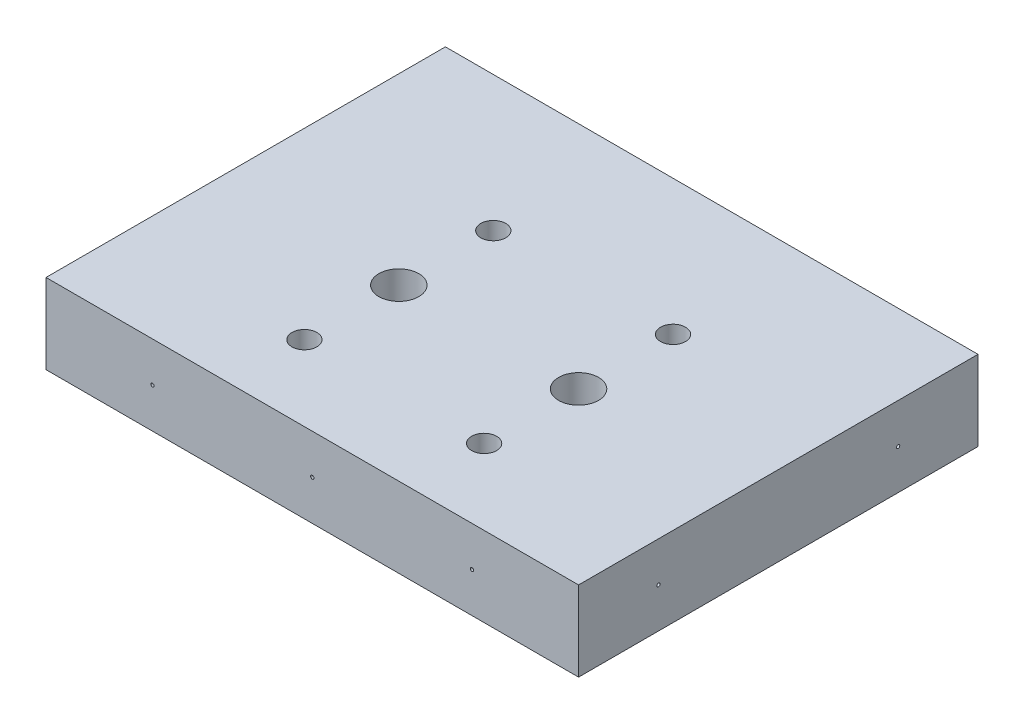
ISO-10303-21;
HEADER;
FILE_DESCRIPTION(('STEP AP214'),'2;1');
FILE_NAME('part.step','',(''),(''),'','','');
FILE_SCHEMA(('AUTOMOTIVE_DESIGN { 1 0 10303 214 1 1 1 1 }'));
ENDSEC;
DATA;
#1=APPLICATION_CONTEXT('core data for automotive mechanical design processes');
#2=APPLICATION_PROTOCOL_DEFINITION('international standard','automotive_design',2000,#1);
#3=PRODUCT_CONTEXT('',#1,'mechanical');
#4=PRODUCT('Part','Part','',(#3));
#5=PRODUCT_RELATED_PRODUCT_CATEGORY('part','',(#4));
#6=PRODUCT_DEFINITION_FORMATION('','',#4);
#7=PRODUCT_DEFINITION_CONTEXT('part definition',#1,'design');
#8=PRODUCT_DEFINITION('design','',#6,#7);
#9=PRODUCT_DEFINITION_SHAPE('','',#8);
#10=(LENGTH_UNIT() NAMED_UNIT(*) SI_UNIT(.MILLI.,.METRE.));
#11=(NAMED_UNIT(*) PLANE_ANGLE_UNIT() SI_UNIT($,.RADIAN.));
#12=(NAMED_UNIT(*) SI_UNIT($,.STERADIAN.) SOLID_ANGLE_UNIT());
#13=UNCERTAINTY_MEASURE_WITH_UNIT(LENGTH_MEASURE(1.E-05),#10,'distance_accuracy_value','');
#14=(GEOMETRIC_REPRESENTATION_CONTEXT(3) GLOBAL_UNCERTAINTY_ASSIGNED_CONTEXT((#13)) GLOBAL_UNIT_ASSIGNED_CONTEXT((#10,
#11,#12)) REPRESENTATION_CONTEXT('',''));
#15=CARTESIAN_POINT('',(0.,0.,0.));
#16=DIRECTION('',(0.,0.,1.));
#17=DIRECTION('',(1.,0.,0.));
#18=AXIS2_PLACEMENT_3D('',#15,#16,#17);
#19=CARTESIAN_POINT('',(0.,38.1,0.));
#20=DIRECTION('',(1.,0.,0.));
#21=DIRECTION('',(0.,0.,-1.));
#22=AXIS2_PLACEMENT_3D('',#19,#20,#21);
#23=PLANE('',#22);
#24=CARTESIAN_POINT('',(0.,19.05,-152.4));
#25=DIRECTION('',(-1.,0.,0.));
#26=DIRECTION('',(0.,0.,1.));
#27=AXIS2_PLACEMENT_3D('',#24,#25,#26);
#28=CIRCLE('',#27,0.793749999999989);
#29=CARTESIAN_POINT('',(0.,19.05,-151.60625));
#30=VERTEX_POINT('',#29);
#31=EDGE_CURVE('E114',#30,#30,#28,.T.);
#32=ORIENTED_EDGE('',*,*,#31,.F.);
#33=EDGE_LOOP('',(#32));
#34=FACE_BOUND('',#33,.T.);
#35=CARTESIAN_POINT('',(0.,19.05,-38.1));
#36=DIRECTION('',(-1.,0.,0.));
#37=DIRECTION('',(0.,0.,1.));
#38=AXIS2_PLACEMENT_3D('',#35,#36,#37);
#39=CIRCLE('',#38,0.793749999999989);
#40=CARTESIAN_POINT('',(0.,19.05,-37.30625));
#41=VERTEX_POINT('',#40);
#42=EDGE_CURVE('E113',#41,#41,#39,.T.);
#43=ORIENTED_EDGE('',*,*,#42,.F.);
#44=EDGE_LOOP('',(#43));
#45=FACE_BOUND('',#44,.T.);
#46=DIRECTION('',(0.,0.,1.));
#47=VECTOR('',#46,1.);
#48=CARTESIAN_POINT('',(0.,0.,0.));
#49=LINE('',#48,#47);
#50=CARTESIAN_POINT('',(0.,0.,-190.5));
#51=VERTEX_POINT('',#50);
#52=CARTESIAN_POINT('',(0.,0.,0.));
#53=VERTEX_POINT('',#52);
#54=EDGE_CURVE('E168',#51,#53,#49,.T.);
#55=ORIENTED_EDGE('',*,*,#54,.T.);
#56=DIRECTION('',(0.,-1.,0.));
#57=VECTOR('',#56,1.);
#58=CARTESIAN_POINT('',(0.,38.1,0.));
#59=LINE('',#58,#57);
#60=CARTESIAN_POINT('',(0.,38.1,0.));
#61=VERTEX_POINT('',#60);
#62=EDGE_CURVE('E11',#61,#53,#59,.T.);
#63=ORIENTED_EDGE('',*,*,#62,.F.);
#64=DIRECTION('',(0.,0.,1.));
#65=VECTOR('',#64,1.);
#66=CARTESIAN_POINT('',(0.,38.1,0.));
#67=LINE('',#66,#65);
#68=CARTESIAN_POINT('',(0.,38.1,-190.5));
#69=VERTEX_POINT('',#68);
#70=EDGE_CURVE('E169',#69,#61,#67,.T.);
#71=ORIENTED_EDGE('',*,*,#70,.F.);
#72=DIRECTION('',(0.,-1.,0.));
#73=VECTOR('',#72,1.);
#74=CARTESIAN_POINT('',(0.,38.1,-190.5));
#75=LINE('',#74,#73);
#76=EDGE_CURVE('E175',#69,#51,#75,.T.);
#77=ORIENTED_EDGE('',*,*,#76,.T.);
#78=EDGE_LOOP('',(#55,#63,#71,#77));
#79=FACE_BOUND('',#78,.T.);
#80=ADVANCED_FACE('F34',(#34,#45,#79),#23,.F.);
#81=CARTESIAN_POINT('',(0.,38.1,0.));
#82=DIRECTION('',(0.,0.,-1.));
#83=DIRECTION('',(-1.,0.,0.));
#84=AXIS2_PLACEMENT_3D('',#81,#82,#83);
#85=PLANE('',#84);
#86=CARTESIAN_POINT('',(50.8,19.05,0.));
#87=DIRECTION('',(0.,0.,1.));
#88=DIRECTION('',(1.,0.,0.));
#89=AXIS2_PLACEMENT_3D('',#86,#87,#88);
#90=CIRCLE('',#89,0.793749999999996);
#91=CARTESIAN_POINT('',(51.59375,19.05,0.));
#92=VERTEX_POINT('',#91);
#93=EDGE_CURVE('E150',#92,#92,#90,.T.);
#94=ORIENTED_EDGE('',*,*,#93,.F.);
#95=EDGE_LOOP('',(#94));
#96=FACE_BOUND('',#95,.T.);
#97=CARTESIAN_POINT('',(203.2,19.05,0.));
#98=DIRECTION('',(0.,0.,1.));
#99=DIRECTION('',(1.,0.,0.));
#100=AXIS2_PLACEMENT_3D('',#97,#98,#99);
#101=CIRCLE('',#100,0.793749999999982);
#102=CARTESIAN_POINT('',(203.99375,19.05,0.));
#103=VERTEX_POINT('',#102);
#104=EDGE_CURVE('E156',#103,#103,#101,.T.);
#105=ORIENTED_EDGE('',*,*,#104,.F.);
#106=EDGE_LOOP('',(#105));
#107=FACE_BOUND('',#106,.T.);
#108=CARTESIAN_POINT('',(127.,19.05,0.));
#109=DIRECTION('',(0.,0.,1.));
#110=DIRECTION('',(1.,0.,0.));
#111=AXIS2_PLACEMENT_3D('',#108,#109,#110);
#112=CIRCLE('',#111,0.793749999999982);
#113=CARTESIAN_POINT('',(127.79375,19.05,0.));
#114=VERTEX_POINT('',#113);
#115=EDGE_CURVE('E162',#114,#114,#112,.T.);
#116=ORIENTED_EDGE('',*,*,#115,.F.);
#117=EDGE_LOOP('',(#116));
#118=FACE_BOUND('',#117,.T.);
#119=DIRECTION('',(1.,0.,0.));
#120=VECTOR('',#119,1.);
#121=CARTESIAN_POINT('',(0.,0.,0.));
#122=LINE('',#121,#120);
#123=CARTESIAN_POINT('',(254.,0.,0.));
#124=VERTEX_POINT('',#123);
#125=EDGE_CURVE('E178',#53,#124,#122,.T.);
#126=ORIENTED_EDGE('',*,*,#125,.T.);
#127=DIRECTION('',(0.,-1.,0.));
#128=VECTOR('',#127,1.);
#129=CARTESIAN_POINT('',(254.,38.1,0.));
#130=LINE('',#129,#128);
#131=CARTESIAN_POINT('',(254.,38.1,0.));
#132=VERTEX_POINT('',#131);
#133=EDGE_CURVE('E42',#132,#124,#130,.T.);
#134=ORIENTED_EDGE('',*,*,#133,.F.);
#135=DIRECTION('',(1.,0.,0.));
#136=VECTOR('',#135,1.);
#137=CARTESIAN_POINT('',(0.,38.1,0.));
#138=LINE('',#137,#136);
#139=EDGE_CURVE('E81',#61,#132,#138,.T.);
#140=ORIENTED_EDGE('',*,*,#139,.F.);
#141=ORIENTED_EDGE('',*,*,#62,.T.);
#142=EDGE_LOOP('',(#126,#134,#140,#141));
#143=FACE_BOUND('',#142,.T.);
#144=ADVANCED_FACE('F202',(#96,#107,#118,#143),#85,.F.);
#145=CARTESIAN_POINT('',(254.,38.1,0.));
#146=DIRECTION('',(-1.,0.,0.));
#147=DIRECTION('',(0.,0.,1.));
#148=AXIS2_PLACEMENT_3D('',#145,#146,#147);
#149=PLANE('',#148);
#150=CARTESIAN_POINT('',(254.,19.05,-152.4));
#151=DIRECTION('',(1.,0.,0.));
#152=DIRECTION('',(0.,0.,-1.));
#153=AXIS2_PLACEMENT_3D('',#150,#151,#152);
#154=CIRCLE('',#153,0.793749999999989);
#155=CARTESIAN_POINT('',(254.,19.05,-153.19375));
#156=VERTEX_POINT('',#155);
#157=EDGE_CURVE('E126',#156,#156,#154,.T.);
#158=ORIENTED_EDGE('',*,*,#157,.F.);
#159=EDGE_LOOP('',(#158));
#160=FACE_BOUND('',#159,.T.);
#161=CARTESIAN_POINT('',(254.,19.05,-38.1000000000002));
#162=DIRECTION('',(1.,0.,0.));
#163=DIRECTION('',(0.,0.,-1.));
#164=AXIS2_PLACEMENT_3D('',#161,#162,#163);
#165=CIRCLE('',#164,0.793749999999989);
#166=CARTESIAN_POINT('',(254.,19.05,-38.8937500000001));
#167=VERTEX_POINT('',#166);
#168=EDGE_CURVE('E132',#167,#167,#165,.T.);
#169=ORIENTED_EDGE('',*,*,#168,.F.);
#170=EDGE_LOOP('',(#169));
#171=FACE_BOUND('',#170,.T.);
#172=DIRECTION('',(0.,0.,-1.));
#173=VECTOR('',#172,1.);
#174=CARTESIAN_POINT('',(254.,0.,0.));
#175=LINE('',#174,#173);
#176=CARTESIAN_POINT('',(254.,0.,-190.5));
#177=VERTEX_POINT('',#176);
#178=EDGE_CURVE('E68',#124,#177,#175,.T.);
#179=ORIENTED_EDGE('',*,*,#178,.T.);
#180=DIRECTION('',(0.,-1.,0.));
#181=VECTOR('',#180,1.);
#182=CARTESIAN_POINT('',(254.,38.1,-190.5));
#183=LINE('',#182,#181);
#184=CARTESIAN_POINT('',(254.,38.1,-190.5));
#185=VERTEX_POINT('',#184);
#186=EDGE_CURVE('E183',#185,#177,#183,.T.);
#187=ORIENTED_EDGE('',*,*,#186,.F.);
#188=DIRECTION('',(0.,0.,-1.));
#189=VECTOR('',#188,1.);
#190=CARTESIAN_POINT('',(254.,38.1,0.));
#191=LINE('',#190,#189);
#192=EDGE_CURVE('E172',#132,#185,#191,.T.);
#193=ORIENTED_EDGE('',*,*,#192,.F.);
#194=ORIENTED_EDGE('',*,*,#133,.T.);
#195=EDGE_LOOP('',(#179,#187,#193,#194));
#196=FACE_BOUND('',#195,.T.);
#197=ADVANCED_FACE('F185',(#160,#171,#196),#149,.F.);
#198=CARTESIAN_POINT('',(0.,38.1,-190.5));
#199=DIRECTION('',(0.,0.,1.));
#200=DIRECTION('',(1.,0.,0.));
#201=AXIS2_PLACEMENT_3D('',#198,#199,#200);
#202=PLANE('',#201);
#203=DIRECTION('',(-1.,0.,0.));
#204=VECTOR('',#203,1.);
#205=CARTESIAN_POINT('',(0.,0.,-190.5));
#206=LINE('',#205,#204);
#207=EDGE_CURVE('E74',#177,#51,#206,.T.);
#208=ORIENTED_EDGE('',*,*,#207,.T.);
#209=ORIENTED_EDGE('',*,*,#76,.F.);
#210=DIRECTION('',(-1.,0.,0.));
#211=VECTOR('',#210,1.);
#212=CARTESIAN_POINT('',(0.,38.1,-190.5));
#213=LINE('',#212,#211);
#214=EDGE_CURVE('E50',#185,#69,#213,.T.);
#215=ORIENTED_EDGE('',*,*,#214,.F.);
#216=ORIENTED_EDGE('',*,*,#186,.T.);
#217=EDGE_LOOP('',(#208,#209,#215,#216));
#218=FACE_BOUND('',#217,.T.);
#219=ADVANCED_FACE('F192',(#218),#202,.F.);
#220=CARTESIAN_POINT('',(0.,38.1,0.));
#221=DIRECTION('',(0.,-1.,0.));
#222=DIRECTION('',(0.,0.,-1.));
#223=AXIS2_PLACEMENT_3D('',#220,#221,#222);
#224=PLANE('',#223);
#225=CARTESIAN_POINT('',(87.3125000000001,38.1,-35.9171875));
#226=DIRECTION('',(0.,1.,0.));
#227=DIRECTION('',(0.,0.,1.));
#228=AXIS2_PLACEMENT_3D('',#225,#226,#227);
#229=CIRCLE('',#228,5.95312499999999);
#230=CARTESIAN_POINT('',(87.3125000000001,38.1,-29.9640625));
#231=VERTEX_POINT('',#230);
#232=EDGE_CURVE('E313',#231,#231,#229,.T.);
#233=ORIENTED_EDGE('',*,*,#232,.F.);
#234=EDGE_LOOP('',(#233));
#235=FACE_BOUND('',#234,.T.);
#236=CARTESIAN_POINT('',(87.3125000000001,38.1,-126.0078125));
#237=DIRECTION('',(0.,1.,0.));
#238=DIRECTION('',(0.,0.,1.));
#239=AXIS2_PLACEMENT_3D('',#236,#237,#238);
#240=CIRCLE('',#239,5.95312499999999);
#241=CARTESIAN_POINT('',(87.3125000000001,38.1,-120.0546875));
#242=VERTEX_POINT('',#241);
#243=EDGE_CURVE('E309',#242,#242,#240,.T.);
#244=ORIENTED_EDGE('',*,*,#243,.F.);
#245=EDGE_LOOP('',(#244));
#246=FACE_BOUND('',#245,.T.);
#247=CARTESIAN_POINT('',(173.0375,38.1,-126.0078125));
#248=DIRECTION('',(0.,1.,0.));
#249=DIRECTION('',(0.,0.,1.));
#250=AXIS2_PLACEMENT_3D('',#247,#248,#249);
#251=CIRCLE('',#250,5.95312499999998);
#252=CARTESIAN_POINT('',(173.0375,38.1,-120.0546875));
#253=VERTEX_POINT('',#252);
#254=EDGE_CURVE('E305',#253,#253,#251,.T.);
#255=ORIENTED_EDGE('',*,*,#254,.F.);
#256=EDGE_LOOP('',(#255));
#257=FACE_BOUND('',#256,.T.);
#258=CARTESIAN_POINT('',(173.0375,38.1,-35.9171875));
#259=DIRECTION('',(0.,1.,0.));
#260=DIRECTION('',(0.,0.,1.));
#261=AXIS2_PLACEMENT_3D('',#258,#259,#260);
#262=CIRCLE('',#261,5.95312499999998);
#263=CARTESIAN_POINT('',(173.0375,38.1,-29.9640625));
#264=VERTEX_POINT('',#263);
#265=EDGE_CURVE('E300',#264,#264,#262,.T.);
#266=ORIENTED_EDGE('',*,*,#265,.F.);
#267=EDGE_LOOP('',(#266));
#268=FACE_BOUND('',#267,.T.);
#269=CARTESIAN_POINT('',(173.0375,38.1,-80.9625));
#270=DIRECTION('',(0.,-1.,0.));
#271=DIRECTION('',(0.,0.,-1.));
#272=AXIS2_PLACEMENT_3D('',#269,#270,#271);
#273=CIRCLE('',#272,9.52499999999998);
#274=CARTESIAN_POINT('',(173.0375,38.1,-90.4875));
#275=VERTEX_POINT('',#274);
#276=EDGE_CURVE('E141',#275,#275,#273,.T.);
#277=ORIENTED_EDGE('',*,*,#276,.T.);
#278=EDGE_LOOP('',(#277));
#279=FACE_BOUND('',#278,.T.);
#280=CARTESIAN_POINT('',(87.3125000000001,38.1,-80.9625));
#281=DIRECTION('',(0.,-1.,0.));
#282=DIRECTION('',(0.,0.,-1.));
#283=AXIS2_PLACEMENT_3D('',#280,#281,#282);
#284=CIRCLE('',#283,9.52499999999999);
#285=CARTESIAN_POINT('',(87.3125000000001,38.1,-90.4875));
#286=VERTEX_POINT('',#285);
#287=EDGE_CURVE('E147',#286,#286,#284,.T.);
#288=ORIENTED_EDGE('',*,*,#287,.T.);
#289=EDGE_LOOP('',(#288));
#290=FACE_BOUND('',#289,.T.);
#291=ORIENTED_EDGE('',*,*,#70,.T.);
#292=ORIENTED_EDGE('',*,*,#139,.T.);
#293=ORIENTED_EDGE('',*,*,#192,.T.);
#294=ORIENTED_EDGE('',*,*,#214,.T.);
#295=EDGE_LOOP('',(#291,#292,#293,#294));
#296=FACE_BOUND('',#295,.T.);
#297=ADVANCED_FACE('F194',(#235,#246,#257,#268,#279,#290,#296),#224,.F.);
#298=CARTESIAN_POINT('',(0.,0.,0.));
#299=DIRECTION('',(0.,-1.,0.));
#300=DIRECTION('',(0.,0.,-1.));
#301=AXIS2_PLACEMENT_3D('',#298,#299,#300);
#302=PLANE('',#301);
#303=CARTESIAN_POINT('',(87.3125000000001,0.,-35.9171875));
#304=DIRECTION('',(0.,1.,0.));
#305=DIRECTION('',(0.,0.,1.));
#306=AXIS2_PLACEMENT_3D('',#303,#304,#305);
#307=CIRCLE('',#306,5.95312499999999);
#308=CARTESIAN_POINT('',(87.3125000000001,0.,-29.9640625));
#309=VERTEX_POINT('',#308);
#310=EDGE_CURVE('E282',#309,#309,#307,.T.);
#311=ORIENTED_EDGE('',*,*,#310,.T.);
#312=EDGE_LOOP('',(#311));
#313=FACE_BOUND('',#312,.T.);
#314=CARTESIAN_POINT('',(87.3125000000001,0.,-126.0078125));
#315=DIRECTION('',(0.,1.,0.));
#316=DIRECTION('',(0.,0.,1.));
#317=AXIS2_PLACEMENT_3D('',#314,#315,#316);
#318=CIRCLE('',#317,5.95312499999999);
#319=CARTESIAN_POINT('',(87.3125000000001,0.,-120.0546875));
#320=VERTEX_POINT('',#319);
#321=EDGE_CURVE('E286',#320,#320,#318,.T.);
#322=ORIENTED_EDGE('',*,*,#321,.T.);
#323=EDGE_LOOP('',(#322));
#324=FACE_BOUND('',#323,.T.);
#325=CARTESIAN_POINT('',(173.0375,0.,-126.0078125));
#326=DIRECTION('',(0.,1.,0.));
#327=DIRECTION('',(0.,0.,1.));
#328=AXIS2_PLACEMENT_3D('',#325,#326,#327);
#329=CIRCLE('',#328,5.95312499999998);
#330=CARTESIAN_POINT('',(173.0375,0.,-120.0546875));
#331=VERTEX_POINT('',#330);
#332=EDGE_CURVE('E290',#331,#331,#329,.T.);
#333=ORIENTED_EDGE('',*,*,#332,.T.);
#334=EDGE_LOOP('',(#333));
#335=FACE_BOUND('',#334,.T.);
#336=CARTESIAN_POINT('',(173.0375,0.,-35.9171875));
#337=DIRECTION('',(0.,1.,0.));
#338=DIRECTION('',(0.,0.,1.));
#339=AXIS2_PLACEMENT_3D('',#336,#337,#338);
#340=CIRCLE('',#339,5.95312499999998);
#341=CARTESIAN_POINT('',(173.0375,0.,-29.9640625));
#342=VERTEX_POINT('',#341);
#343=EDGE_CURVE('E120',#342,#342,#340,.T.);
#344=ORIENTED_EDGE('',*,*,#343,.T.);
#345=EDGE_LOOP('',(#344));
#346=FACE_BOUND('',#345,.T.);
#347=CARTESIAN_POINT('',(173.0375,0.,-80.9625));
#348=DIRECTION('',(0.,-1.,0.));
#349=DIRECTION('',(0.,0.,-1.));
#350=AXIS2_PLACEMENT_3D('',#347,#348,#349);
#351=CIRCLE('',#350,9.52500000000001);
#352=CARTESIAN_POINT('',(173.0375,0.,-90.4875));
#353=VERTEX_POINT('',#352);
#354=EDGE_CURVE('E138',#353,#353,#351,.T.);
#355=ORIENTED_EDGE('',*,*,#354,.F.);
#356=EDGE_LOOP('',(#355));
#357=FACE_BOUND('',#356,.T.);
#358=CARTESIAN_POINT('',(87.3125000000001,0.,-80.9625));
#359=DIRECTION('',(0.,-1.,0.));
#360=DIRECTION('',(0.,0.,-1.));
#361=AXIS2_PLACEMENT_3D('',#358,#359,#360);
#362=CIRCLE('',#361,9.52499999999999);
#363=CARTESIAN_POINT('',(87.3125000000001,0.,-90.4875));
#364=VERTEX_POINT('',#363);
#365=EDGE_CURVE('E144',#364,#364,#362,.T.);
#366=ORIENTED_EDGE('',*,*,#365,.F.);
#367=EDGE_LOOP('',(#366));
#368=FACE_BOUND('',#367,.T.);
#369=ORIENTED_EDGE('',*,*,#54,.F.);
#370=ORIENTED_EDGE('',*,*,#207,.F.);
#371=ORIENTED_EDGE('',*,*,#178,.F.);
#372=ORIENTED_EDGE('',*,*,#125,.F.);
#373=EDGE_LOOP('',(#369,#370,#371,#372));
#374=FACE_BOUND('',#373,.T.);
#375=ADVANCED_FACE('F188',(#313,#324,#335,#346,#357,#368,#374),#302,.T.);
#376=CARTESIAN_POINT('',(127.,19.05,-50.8));
#377=DIRECTION('',(0.,0.,1.));
#378=DIRECTION('',(1.,0.,0.));
#379=AXIS2_PLACEMENT_3D('',#376,#377,#378);
#380=CONICAL_SURFACE('',#379,0.793749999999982,1.02974425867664);
#381=CARTESIAN_POINT('',(127.,19.05,-51.2769331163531));
#382=VERTEX_POINT('',#381);
#383=VERTEX_LOOP('',#382);
#384=FACE_BOUND('',#383,.T.);
#385=CARTESIAN_POINT('',(127.,19.05,-50.8));
#386=DIRECTION('',(0.,0.,1.));
#387=DIRECTION('',(1.,0.,0.));
#388=AXIS2_PLACEMENT_3D('',#385,#386,#387);
#389=CIRCLE('',#388,0.793749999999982);
#390=CARTESIAN_POINT('',(127.79375,19.05,-50.8));
#391=VERTEX_POINT('',#390);
#392=EDGE_CURVE('E165',#391,#391,#389,.T.);
#393=ORIENTED_EDGE('',*,*,#392,.T.);
#394=EDGE_LOOP('',(#393));
#395=FACE_BOUND('',#394,.T.);
#396=ADVANCED_FACE('F271',(#384,#395),#380,.F.);
#397=CARTESIAN_POINT('',(127.,19.05,0.));
#398=DIRECTION('',(0.,0.,1.));
#399=DIRECTION('',(1.,0.,0.));
#400=AXIS2_PLACEMENT_3D('',#397,#398,#399);
#401=CYLINDRICAL_SURFACE('',#400,0.793749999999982);
#402=ORIENTED_EDGE('',*,*,#392,.F.);
#403=EDGE_LOOP('',(#402));
#404=FACE_BOUND('',#403,.T.);
#405=ORIENTED_EDGE('',*,*,#115,.T.);
#406=EDGE_LOOP('',(#405));
#407=FACE_BOUND('',#406,.T.);
#408=ADVANCED_FACE('F267',(#404,#407),#401,.F.);
#409=CARTESIAN_POINT('',(203.2,19.05,-50.8));
#410=DIRECTION('',(0.,0.,1.));
#411=DIRECTION('',(1.,0.,0.));
#412=AXIS2_PLACEMENT_3D('',#409,#410,#411);
#413=CONICAL_SURFACE('',#412,0.793749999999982,1.02974425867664);
#414=CARTESIAN_POINT('',(203.2,19.05,-51.2769331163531));
#415=VERTEX_POINT('',#414);
#416=VERTEX_LOOP('',#415);
#417=FACE_BOUND('',#416,.T.);
#418=CARTESIAN_POINT('',(203.2,19.05,-50.8));
#419=DIRECTION('',(0.,0.,1.));
#420=DIRECTION('',(1.,0.,0.));
#421=AXIS2_PLACEMENT_3D('',#418,#419,#420);
#422=CIRCLE('',#421,0.793749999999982);
#423=CARTESIAN_POINT('',(203.99375,19.05,-50.8));
#424=VERTEX_POINT('',#423);
#425=EDGE_CURVE('E159',#424,#424,#422,.T.);
#426=ORIENTED_EDGE('',*,*,#425,.T.);
#427=EDGE_LOOP('',(#426));
#428=FACE_BOUND('',#427,.T.);
#429=ADVANCED_FACE('F263',(#417,#428),#413,.F.);
#430=CARTESIAN_POINT('',(203.2,19.05,0.));
#431=DIRECTION('',(0.,0.,1.));
#432=DIRECTION('',(1.,0.,0.));
#433=AXIS2_PLACEMENT_3D('',#430,#431,#432);
#434=CYLINDRICAL_SURFACE('',#433,0.793749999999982);
#435=ORIENTED_EDGE('',*,*,#425,.F.);
#436=EDGE_LOOP('',(#435));
#437=FACE_BOUND('',#436,.T.);
#438=ORIENTED_EDGE('',*,*,#104,.T.);
#439=EDGE_LOOP('',(#438));
#440=FACE_BOUND('',#439,.T.);
#441=ADVANCED_FACE('F259',(#437,#440),#434,.F.);
#442=CARTESIAN_POINT('',(50.8,19.05,-50.8));
#443=DIRECTION('',(0.,0.,1.));
#444=DIRECTION('',(1.,0.,0.));
#445=AXIS2_PLACEMENT_3D('',#442,#443,#444);
#446=CONICAL_SURFACE('',#445,0.793749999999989,1.02974425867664);
#447=CARTESIAN_POINT('',(50.8,19.05,-51.2769331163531));
#448=VERTEX_POINT('',#447);
#449=VERTEX_LOOP('',#448);
#450=FACE_BOUND('',#449,.T.);
#451=CARTESIAN_POINT('',(50.8,19.05,-50.8));
#452=DIRECTION('',(0.,0.,1.));
#453=DIRECTION('',(1.,0.,0.));
#454=AXIS2_PLACEMENT_3D('',#451,#452,#453);
#455=CIRCLE('',#454,0.793749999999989);
#456=CARTESIAN_POINT('',(51.59375,19.05,-50.8));
#457=VERTEX_POINT('',#456);
#458=EDGE_CURVE('E153',#457,#457,#455,.T.);
#459=ORIENTED_EDGE('',*,*,#458,.T.);
#460=EDGE_LOOP('',(#459));
#461=FACE_BOUND('',#460,.T.);
#462=ADVANCED_FACE('F255',(#450,#461),#446,.F.);
#463=CARTESIAN_POINT('',(50.8,19.05,0.));
#464=DIRECTION('',(0.,0.,1.));
#465=DIRECTION('',(1.,0.,0.));
#466=AXIS2_PLACEMENT_3D('',#463,#464,#465);
#467=CYLINDRICAL_SURFACE('',#466,0.793749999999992);
#468=ORIENTED_EDGE('',*,*,#458,.F.);
#469=EDGE_LOOP('',(#468));
#470=FACE_BOUND('',#469,.T.);
#471=ORIENTED_EDGE('',*,*,#93,.T.);
#472=EDGE_LOOP('',(#471));
#473=FACE_BOUND('',#472,.T.);
#474=ADVANCED_FACE('F251',(#470,#473),#467,.F.);
#475=CARTESIAN_POINT('',(87.3125000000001,0.,-80.9625));
#476=DIRECTION('',(0.,-1.,0.));
#477=DIRECTION('',(0.,0.,-1.));
#478=AXIS2_PLACEMENT_3D('',#475,#476,#477);
#479=CYLINDRICAL_SURFACE('',#478,9.52499999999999);
#480=ORIENTED_EDGE('',*,*,#287,.F.);
#481=EDGE_LOOP('',(#480));
#482=FACE_BOUND('',#481,.T.);
#483=ORIENTED_EDGE('',*,*,#365,.T.);
#484=EDGE_LOOP('',(#483));
#485=FACE_BOUND('',#484,.T.);
#486=ADVANCED_FACE('F247',(#482,#485),#479,.F.);
#487=CARTESIAN_POINT('',(173.0375,0.,-80.9625));
#488=DIRECTION('',(0.,-1.,0.));
#489=DIRECTION('',(0.,0.,-1.));
#490=AXIS2_PLACEMENT_3D('',#487,#488,#489);
#491=CYLINDRICAL_SURFACE('',#490,9.52499999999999);
#492=ORIENTED_EDGE('',*,*,#276,.F.);
#493=EDGE_LOOP('',(#492));
#494=FACE_BOUND('',#493,.T.);
#495=ORIENTED_EDGE('',*,*,#354,.T.);
#496=EDGE_LOOP('',(#495));
#497=FACE_BOUND('',#496,.T.);
#498=ADVANCED_FACE('F243',(#494,#497),#491,.F.);
#499=CARTESIAN_POINT('',(215.9,19.05,-38.1000000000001));
#500=DIRECTION('',(1.,0.,0.));
#501=DIRECTION('',(0.,0.,-1.));
#502=AXIS2_PLACEMENT_3D('',#499,#500,#501);
#503=CONICAL_SURFACE('',#502,0.793749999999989,1.02974425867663);
#504=CARTESIAN_POINT('',(215.423066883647,19.05,-38.1000000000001));
#505=VERTEX_POINT('',#504);
#506=VERTEX_LOOP('',#505);
#507=FACE_BOUND('',#506,.T.);
#508=CARTESIAN_POINT('',(215.9,19.05,-38.1000000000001));
#509=DIRECTION('',(1.,0.,0.));
#510=DIRECTION('',(0.,0.,-1.));
#511=AXIS2_PLACEMENT_3D('',#508,#509,#510);
#512=CIRCLE('',#511,0.793749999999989);
#513=CARTESIAN_POINT('',(215.9,19.05,-38.8937500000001));
#514=VERTEX_POINT('',#513);
#515=EDGE_CURVE('E135',#514,#514,#512,.T.);
#516=ORIENTED_EDGE('',*,*,#515,.T.);
#517=EDGE_LOOP('',(#516));
#518=FACE_BOUND('',#517,.T.);
#519=ADVANCED_FACE('F239',(#507,#518),#503,.F.);
#520=CARTESIAN_POINT('',(254.,19.05,-38.1000000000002));
#521=DIRECTION('',(1.,0.,0.));
#522=DIRECTION('',(0.,0.,-1.));
#523=AXIS2_PLACEMENT_3D('',#520,#521,#522);
#524=CYLINDRICAL_SURFACE('',#523,0.793749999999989);
#525=ORIENTED_EDGE('',*,*,#515,.F.);
#526=EDGE_LOOP('',(#525));
#527=FACE_BOUND('',#526,.T.);
#528=ORIENTED_EDGE('',*,*,#168,.T.);
#529=EDGE_LOOP('',(#528));
#530=FACE_BOUND('',#529,.T.);
#531=ADVANCED_FACE('F235',(#527,#530),#524,.F.);
#532=CARTESIAN_POINT('',(215.9,19.05,-152.4));
#533=DIRECTION('',(1.,0.,0.));
#534=DIRECTION('',(0.,0.,-1.));
#535=AXIS2_PLACEMENT_3D('',#532,#533,#534);
#536=CONICAL_SURFACE('',#535,0.793749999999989,1.02974425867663);
#537=CARTESIAN_POINT('',(215.423066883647,19.05,-152.4));
#538=VERTEX_POINT('',#537);
#539=VERTEX_LOOP('',#538);
#540=FACE_BOUND('',#539,.T.);
#541=CARTESIAN_POINT('',(215.9,19.05,-152.4));
#542=DIRECTION('',(1.,0.,0.));
#543=DIRECTION('',(0.,0.,-1.));
#544=AXIS2_PLACEMENT_3D('',#541,#542,#543);
#545=CIRCLE('',#544,0.793749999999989);
#546=CARTESIAN_POINT('',(215.9,19.05,-153.19375));
#547=VERTEX_POINT('',#546);
#548=EDGE_CURVE('E129',#547,#547,#545,.T.);
#549=ORIENTED_EDGE('',*,*,#548,.T.);
#550=EDGE_LOOP('',(#549));
#551=FACE_BOUND('',#550,.T.);
#552=ADVANCED_FACE('F231',(#540,#551),#536,.F.);
#553=CARTESIAN_POINT('',(254.,19.05,-152.4));
#554=DIRECTION('',(1.,0.,0.));
#555=DIRECTION('',(0.,0.,-1.));
#556=AXIS2_PLACEMENT_3D('',#553,#554,#555);
#557=CYLINDRICAL_SURFACE('',#556,0.793749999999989);
#558=ORIENTED_EDGE('',*,*,#548,.F.);
#559=EDGE_LOOP('',(#558));
#560=FACE_BOUND('',#559,.T.);
#561=ORIENTED_EDGE('',*,*,#157,.T.);
#562=EDGE_LOOP('',(#561));
#563=FACE_BOUND('',#562,.T.);
#564=ADVANCED_FACE('F223',(#560,#563),#557,.F.);
#565=CARTESIAN_POINT('',(38.1,19.05,-38.1));
#566=DIRECTION('',(-1.,0.,0.));
#567=DIRECTION('',(0.,0.,1.));
#568=AXIS2_PLACEMENT_3D('',#565,#566,#567);
#569=CONICAL_SURFACE('',#568,0.793749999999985,1.02974425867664);
#570=CARTESIAN_POINT('',(38.5769331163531,19.05,-38.1));
#571=VERTEX_POINT('',#570);
#572=VERTEX_LOOP('',#571);
#573=FACE_BOUND('',#572,.T.);
#574=CARTESIAN_POINT('',(38.1,19.05,-38.1));
#575=DIRECTION('',(-1.,0.,0.));
#576=DIRECTION('',(0.,0.,1.));
#577=AXIS2_PLACEMENT_3D('',#574,#575,#576);
#578=CIRCLE('',#577,0.793749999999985);
#579=CARTESIAN_POINT('',(38.1,19.05,-37.30625));
#580=VERTEX_POINT('',#579);
#581=EDGE_CURVE('E117',#580,#580,#578,.T.);
#582=ORIENTED_EDGE('',*,*,#581,.T.);
#583=EDGE_LOOP('',(#582));
#584=FACE_BOUND('',#583,.T.);
#585=ADVANCED_FACE('F217',(#573,#584),#569,.F.);
#586=CARTESIAN_POINT('',(0.,19.05,-38.1));
#587=DIRECTION('',(-1.,0.,0.));
#588=DIRECTION('',(0.,0.,1.));
#589=AXIS2_PLACEMENT_3D('',#586,#587,#588);
#590=CYLINDRICAL_SURFACE('',#589,0.793749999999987);
#591=ORIENTED_EDGE('',*,*,#581,.F.);
#592=EDGE_LOOP('',(#591));
#593=FACE_BOUND('',#592,.T.);
#594=ORIENTED_EDGE('',*,*,#42,.T.);
#595=EDGE_LOOP('',(#594));
#596=FACE_BOUND('',#595,.T.);
#597=ADVANCED_FACE('F107',(#593,#596),#590,.F.);
#598=CARTESIAN_POINT('',(38.1,19.05,-152.4));
#599=DIRECTION('',(-1.,0.,0.));
#600=DIRECTION('',(0.,0.,1.));
#601=AXIS2_PLACEMENT_3D('',#598,#599,#600);
#602=CONICAL_SURFACE('',#601,0.793749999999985,1.02974425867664);
#603=CARTESIAN_POINT('',(38.5769331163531,19.05,-152.4));
#604=VERTEX_POINT('',#603);
#605=VERTEX_LOOP('',#604);
#606=FACE_BOUND('',#605,.T.);
#607=CARTESIAN_POINT('',(38.1,19.05,-152.4));
#608=DIRECTION('',(-1.,0.,0.));
#609=DIRECTION('',(0.,0.,1.));
#610=AXIS2_PLACEMENT_3D('',#607,#608,#609);
#611=CIRCLE('',#610,0.793749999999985);
#612=CARTESIAN_POINT('',(38.1,19.05,-151.60625));
#613=VERTEX_POINT('',#612);
#614=EDGE_CURVE('E111',#613,#613,#611,.T.);
#615=ORIENTED_EDGE('',*,*,#614,.T.);
#616=EDGE_LOOP('',(#615));
#617=FACE_BOUND('',#616,.T.);
#618=ADVANCED_FACE('F103',(#606,#617),#602,.F.);
#619=CARTESIAN_POINT('',(0.,19.05,-152.4));
#620=DIRECTION('',(-1.,0.,0.));
#621=DIRECTION('',(0.,0.,1.));
#622=AXIS2_PLACEMENT_3D('',#619,#620,#621);
#623=CYLINDRICAL_SURFACE('',#622,0.793749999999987);
#624=ORIENTED_EDGE('',*,*,#614,.F.);
#625=EDGE_LOOP('',(#624));
#626=FACE_BOUND('',#625,.T.);
#627=ORIENTED_EDGE('',*,*,#31,.T.);
#628=EDGE_LOOP('',(#627));
#629=FACE_BOUND('',#628,.T.);
#630=ADVANCED_FACE('F106',(#626,#629),#623,.F.);
#631=CARTESIAN_POINT('',(173.0375,38.1,-35.9171875));
#632=DIRECTION('',(0.,1.,0.));
#633=DIRECTION('',(0.,0.,1.));
#634=AXIS2_PLACEMENT_3D('',#631,#632,#633);
#635=CYLINDRICAL_SURFACE('',#634,5.95312499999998);
#636=ORIENTED_EDGE('',*,*,#343,.F.);
#637=EDGE_LOOP('',(#636));
#638=FACE_BOUND('',#637,.T.);
#639=ORIENTED_EDGE('',*,*,#265,.T.);
#640=EDGE_LOOP('',(#639));
#641=FACE_BOUND('',#640,.T.);
#642=ADVANCED_FACE('F329',(#638,#641),#635,.F.);
#643=CARTESIAN_POINT('',(173.0375,38.1,-126.0078125));
#644=DIRECTION('',(0.,1.,0.));
#645=DIRECTION('',(0.,0.,1.));
#646=AXIS2_PLACEMENT_3D('',#643,#644,#645);
#647=CYLINDRICAL_SURFACE('',#646,5.95312499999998);
#648=ORIENTED_EDGE('',*,*,#332,.F.);
#649=EDGE_LOOP('',(#648));
#650=FACE_BOUND('',#649,.T.);
#651=ORIENTED_EDGE('',*,*,#254,.T.);
#652=EDGE_LOOP('',(#651));
#653=FACE_BOUND('',#652,.T.);
#654=ADVANCED_FACE('F331',(#650,#653),#647,.F.);
#655=CARTESIAN_POINT('',(87.3125000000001,38.1,-126.0078125));
#656=DIRECTION('',(0.,1.,0.));
#657=DIRECTION('',(0.,0.,1.));
#658=AXIS2_PLACEMENT_3D('',#655,#656,#657);
#659=CYLINDRICAL_SURFACE('',#658,5.95312499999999);
#660=ORIENTED_EDGE('',*,*,#321,.F.);
#661=EDGE_LOOP('',(#660));
#662=FACE_BOUND('',#661,.T.);
#663=ORIENTED_EDGE('',*,*,#243,.T.);
#664=EDGE_LOOP('',(#663));
#665=FACE_BOUND('',#664,.T.);
#666=ADVANCED_FACE('F337',(#662,#665),#659,.F.);
#667=CARTESIAN_POINT('',(87.3125000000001,38.1,-35.9171875));
#668=DIRECTION('',(0.,1.,0.));
#669=DIRECTION('',(0.,0.,1.));
#670=AXIS2_PLACEMENT_3D('',#667,#668,#669);
#671=CYLINDRICAL_SURFACE('',#670,5.95312499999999);
#672=ORIENTED_EDGE('',*,*,#310,.F.);
#673=EDGE_LOOP('',(#672));
#674=FACE_BOUND('',#673,.T.);
#675=ORIENTED_EDGE('',*,*,#232,.T.);
#676=EDGE_LOOP('',(#675));
#677=FACE_BOUND('',#676,.T.);
#678=ADVANCED_FACE('F317',(#674,#677),#671,.F.);
#679=CLOSED_SHELL('',(#80,#144,#197,#219,#297,#375,#396,#408,#429,#441,#462,#474,#486,#498,#519,
#531,#552,#564,#585,#597,#618,#630,#642,#654,#666,#678));
#680=MANIFOLD_SOLID_BREP('B2',#679);
#681=ADVANCED_BREP_SHAPE_REPRESENTATION('',(#18,#680),#14);
#682=SHAPE_DEFINITION_REPRESENTATION(#9,#681);
ENDSEC;
END-ISO-10303-21;
